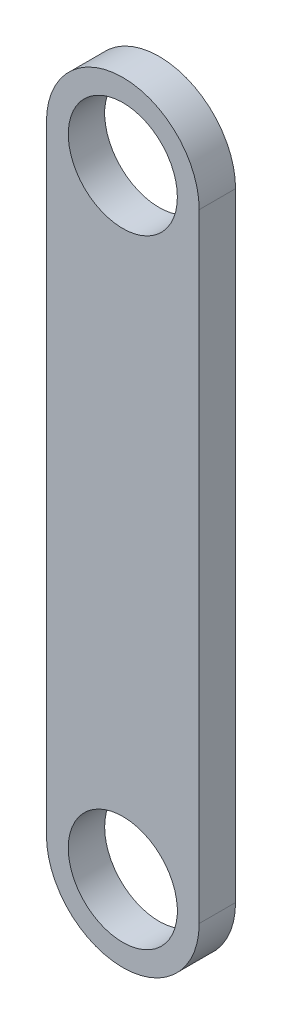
from build123d import *

# Parameters (mm, degrees)
SKETCH_SWINGING_ARM_R = 7.5
SWINGING_ARM_DEPTH    = 5


with BuildPart() as part:
    # Sketch_Swinging Arm → Swinging Arm (new body)
    with BuildSketch(Plane.XY):
        with BuildLine():
            Line((-10.5, 42.5), (-10.5, -42.5))
            ThreePointArc((-10.5, -42.5), (0, -53), (10.5, -42.5))
            Line((10.5, -42.5), (10.5, 42.5))
            ThreePointArc((10.5, 42.5), (0, 53), (-10.5, 42.5))
        make_face()
        with Locations((0, 42.5)):
            Circle(SKETCH_SWINGING_ARM_R, mode=Mode.SUBTRACT)
        with Locations(Location((0, -42.5, 0), (0, 0, 180))):
            Circle(SKETCH_SWINGING_ARM_R, mode=Mode.SUBTRACT)
    extrude(amount=-SWINGING_ARM_DEPTH)


solid = part.part
